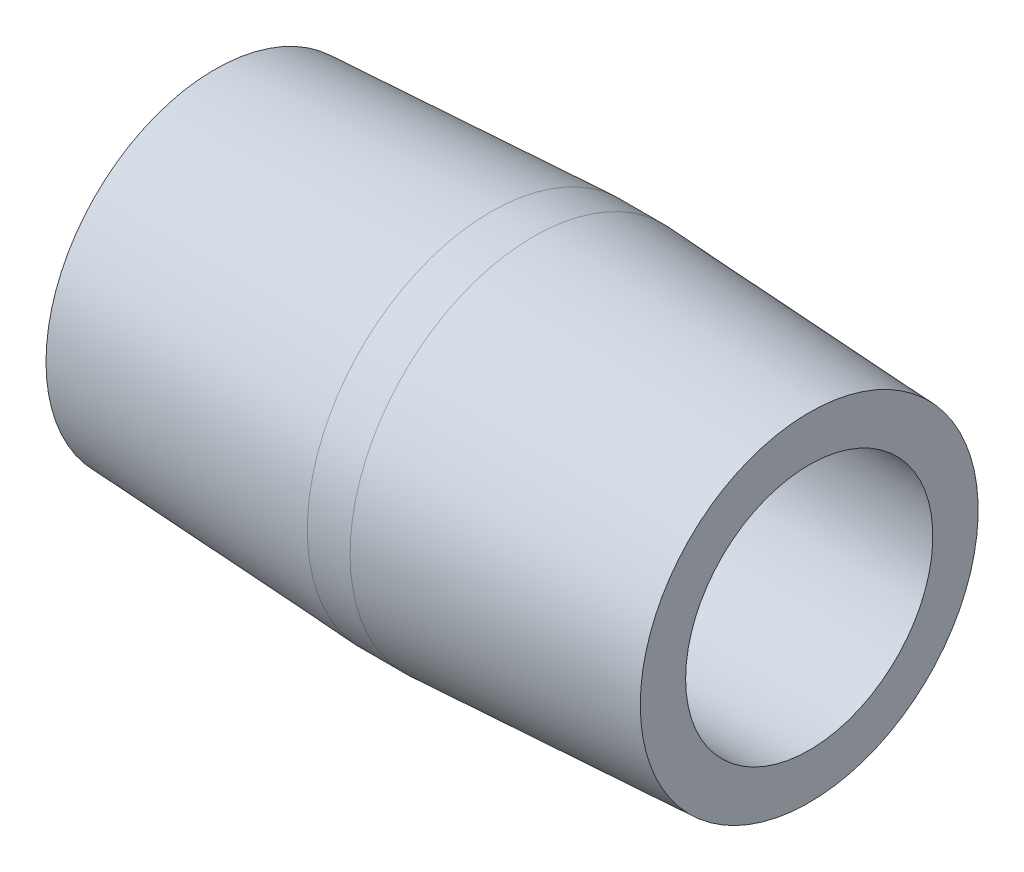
ISO-10303-21;
HEADER;
FILE_DESCRIPTION(('STEP AP214'),'2;1');
FILE_NAME('part.step','',(''),(''),'','','');
FILE_SCHEMA(('AUTOMOTIVE_DESIGN { 1 0 10303 214 1 1 1 1 }'));
ENDSEC;
DATA;
#1=APPLICATION_CONTEXT('core data for automotive mechanical design processes');
#2=APPLICATION_PROTOCOL_DEFINITION('international standard','automotive_design',2000,#1);
#3=PRODUCT_CONTEXT('',#1,'mechanical');
#4=PRODUCT('Part','Part','',(#3));
#5=PRODUCT_RELATED_PRODUCT_CATEGORY('part','',(#4));
#6=PRODUCT_DEFINITION_FORMATION('','',#4);
#7=PRODUCT_DEFINITION_CONTEXT('part definition',#1,'design');
#8=PRODUCT_DEFINITION('design','',#6,#7);
#9=PRODUCT_DEFINITION_SHAPE('','',#8);
#10=(LENGTH_UNIT() NAMED_UNIT(*) SI_UNIT(.MILLI.,.METRE.));
#11=(NAMED_UNIT(*) PLANE_ANGLE_UNIT() SI_UNIT($,.RADIAN.));
#12=(NAMED_UNIT(*) SI_UNIT($,.STERADIAN.) SOLID_ANGLE_UNIT());
#13=UNCERTAINTY_MEASURE_WITH_UNIT(LENGTH_MEASURE(1.E-05),#10,'distance_accuracy_value','');
#14=(GEOMETRIC_REPRESENTATION_CONTEXT(3) GLOBAL_UNCERTAINTY_ASSIGNED_CONTEXT((#13)) GLOBAL_UNIT_ASSIGNED_CONTEXT((#10,
#11,#12)) REPRESENTATION_CONTEXT('',''));
#15=CARTESIAN_POINT('',(0.,0.,0.));
#16=DIRECTION('',(0.,0.,1.));
#17=DIRECTION('',(1.,0.,0.));
#18=AXIS2_PLACEMENT_3D('',#15,#16,#17);
#19=CARTESIAN_POINT('',(22.225,0.,-4.62277681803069));
#20=DIRECTION('',(-1.,0.,0.));
#21=DIRECTION('',(0.,0.,1.));
#22=AXIS2_PLACEMENT_3D('',#19,#20,#21);
#23=PLANE('',#22);
#24=CARTESIAN_POINT('',(22.225,0.,0.));
#25=DIRECTION('',(-1.,0.,0.));
#26=DIRECTION('',(0.,0.,1.));
#27=AXIS2_PLACEMENT_3D('',#24,#25,#26);
#28=CIRCLE('',#27,6.31752683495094);
#29=CARTESIAN_POINT('',(22.225,0.,6.31752683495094));
#30=VERTEX_POINT('',#29);
#31=EDGE_CURVE('E10',#30,#30,#28,.T.);
#32=ORIENTED_EDGE('',*,*,#31,.F.);
#33=EDGE_LOOP('',(#32));
#34=FACE_BOUND('',#33,.T.);
#35=CARTESIAN_POINT('',(22.225,0.,0.));
#36=DIRECTION('',(-1.,0.,0.));
#37=DIRECTION('',(0.,0.,1.));
#38=AXIS2_PLACEMENT_3D('',#35,#36,#37);
#39=CIRCLE('',#38,4.62277681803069);
#40=CARTESIAN_POINT('',(22.225,0.,4.62277681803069));
#41=VERTEX_POINT('',#40);
#42=EDGE_CURVE('E52',#41,#41,#39,.T.);
#43=ORIENTED_EDGE('',*,*,#42,.T.);
#44=EDGE_LOOP('',(#43));
#45=FACE_BOUND('',#44,.T.);
#46=ADVANCED_FACE('F30',(#34,#45),#23,.F.);
#47=CARTESIAN_POINT('',(22.225,0.,0.));
#48=DIRECTION('',(-1.,0.,0.));
#49=DIRECTION('',(0.,0.,1.));
#50=AXIS2_PLACEMENT_3D('',#47,#48,#49);
#51=CONICAL_SURFACE('',#50,6.31752683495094,0.0523598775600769);
#52=CARTESIAN_POINT('',(11.9126000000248,0.,0.));
#53=DIRECTION('',(-1.,0.,0.));
#54=DIRECTION('',(0.,0.,1.));
#55=AXIS2_PLACEMENT_3D('',#52,#53,#54);
#56=CIRCLE('',#55,6.85797681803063);
#57=CARTESIAN_POINT('',(11.9126000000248,0.,6.85797681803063));
#58=VERTEX_POINT('',#57);
#59=EDGE_CURVE('E36',#58,#58,#56,.T.);
#60=ORIENTED_EDGE('',*,*,#59,.F.);
#61=EDGE_LOOP('',(#60));
#62=FACE_BOUND('',#61,.T.);
#63=ORIENTED_EDGE('',*,*,#31,.T.);
#64=EDGE_LOOP('',(#63));
#65=FACE_BOUND('',#64,.T.);
#66=ADVANCED_FACE('F77',(#62,#65),#51,.T.);
#67=CARTESIAN_POINT('',(-6.37599469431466,0.,0.));
#68=DIRECTION('',(-1.,0.,0.));
#69=DIRECTION('',(0.,0.,1.));
#70=AXIS2_PLACEMENT_3D('',#67,#68,#69);
#71=CYLINDRICAL_SURFACE('',#70,6.85797681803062);
#72=CARTESIAN_POINT('',(10.3123999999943,0.,0.));
#73=DIRECTION('',(-1.,0.,0.));
#74=DIRECTION('',(0.,0.,1.));
#75=AXIS2_PLACEMENT_3D('',#72,#73,#74);
#76=CIRCLE('',#75,6.8579768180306);
#77=CARTESIAN_POINT('',(10.3123999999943,0.,6.8579768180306));
#78=VERTEX_POINT('',#77);
#79=EDGE_CURVE('E40',#78,#78,#76,.T.);
#80=ORIENTED_EDGE('',*,*,#79,.F.);
#81=EDGE_LOOP('',(#80));
#82=FACE_BOUND('',#81,.T.);
#83=ORIENTED_EDGE('',*,*,#59,.T.);
#84=EDGE_LOOP('',(#83));
#85=FACE_BOUND('',#84,.T.);
#86=ADVANCED_FACE('F72',(#82,#85),#71,.T.);
#87=CARTESIAN_POINT('',(10.3123999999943,0.,0.));
#88=DIRECTION('',(1.,0.,0.));
#89=DIRECTION('',(0.,0.,-1.));
#90=AXIS2_PLACEMENT_3D('',#87,#88,#89);
#91=CONICAL_SURFACE('',#90,6.8579768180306,0.0523598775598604);
#92=CARTESIAN_POINT('',(1.90819582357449E-11,0.,0.));
#93=DIRECTION('',(-1.,0.,0.));
#94=DIRECTION('',(0.,0.,1.));
#95=AXIS2_PLACEMENT_3D('',#92,#93,#94);
#96=CIRCLE('',#95,6.31752683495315);
#97=CARTESIAN_POINT('',(1.90819582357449E-11,0.,6.31752683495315));
#98=VERTEX_POINT('',#97);
#99=EDGE_CURVE('E44',#98,#98,#96,.T.);
#100=ORIENTED_EDGE('',*,*,#99,.F.);
#101=EDGE_LOOP('',(#100));
#102=FACE_BOUND('',#101,.T.);
#103=ORIENTED_EDGE('',*,*,#79,.T.);
#104=EDGE_LOOP('',(#103));
#105=FACE_BOUND('',#104,.T.);
#106=ADVANCED_FACE('F66',(#102,#105),#91,.T.);
#107=CARTESIAN_POINT('',(1.90819582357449E-11,0.,-6.31752683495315));
#108=DIRECTION('',(1.,0.,0.));
#109=DIRECTION('',(0.,0.,-1.));
#110=AXIS2_PLACEMENT_3D('',#107,#108,#109);
#111=PLANE('',#110);
#112=CARTESIAN_POINT('',(1.90819582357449E-11,0.,0.));
#113=DIRECTION('',(-1.,0.,0.));
#114=DIRECTION('',(0.,0.,1.));
#115=AXIS2_PLACEMENT_3D('',#112,#113,#114);
#116=CIRCLE('',#115,4.62277681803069);
#117=CARTESIAN_POINT('',(1.90819582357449E-11,0.,4.62277681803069));
#118=VERTEX_POINT('',#117);
#119=EDGE_CURVE('E49',#118,#118,#116,.T.);
#120=ORIENTED_EDGE('',*,*,#119,.F.);
#121=EDGE_LOOP('',(#120));
#122=FACE_BOUND('',#121,.T.);
#123=ORIENTED_EDGE('',*,*,#99,.T.);
#124=EDGE_LOOP('',(#123));
#125=FACE_BOUND('',#124,.T.);
#126=ADVANCED_FACE('F60',(#122,#125),#111,.F.);
#127=CARTESIAN_POINT('',(-6.37599469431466,0.,0.));
#128=DIRECTION('',(-1.,0.,0.));
#129=DIRECTION('',(0.,0.,1.));
#130=AXIS2_PLACEMENT_3D('',#127,#128,#129);
#131=CYLINDRICAL_SURFACE('',#130,4.62277681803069);
#132=ORIENTED_EDGE('',*,*,#42,.F.);
#133=EDGE_LOOP('',(#132));
#134=FACE_BOUND('',#133,.T.);
#135=ORIENTED_EDGE('',*,*,#119,.T.);
#136=EDGE_LOOP('',(#135));
#137=FACE_BOUND('',#136,.T.);
#138=ADVANCED_FACE('F57',(#134,#137),#131,.F.);
#139=CLOSED_SHELL('',(#46,#66,#86,#106,#126,#138));
#140=MANIFOLD_SOLID_BREP('B2',#139);
#141=ADVANCED_BREP_SHAPE_REPRESENTATION('',(#18,#140),#14);
#142=SHAPE_DEFINITION_REPRESENTATION(#9,#141);
ENDSEC;
END-ISO-10303-21;
